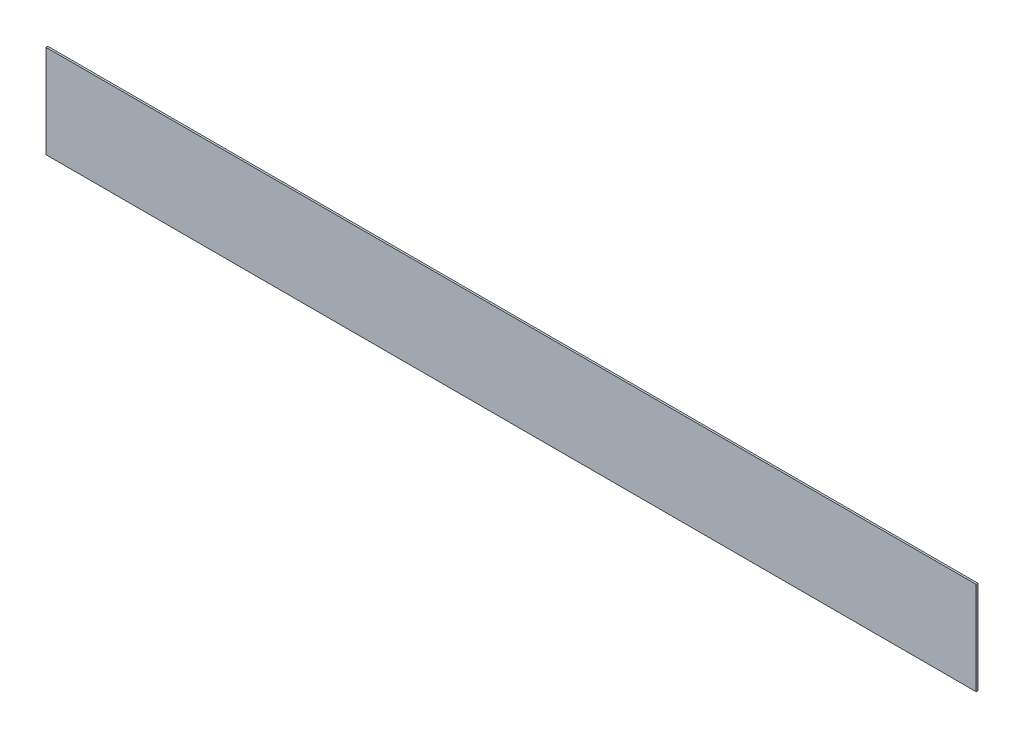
from build123d import *

# Parameters (mm, degrees)
ESQUISSE1_W        = 5000
ESQUISSE1_H        = 500
BOSS_EXTRU_1_DEPTH = 10


with BuildPart() as part:
    # Esquisse1 → Boss.-Extru.1 (new body)
    with BuildSketch(Plane.XY):
        with Locations((2500, 250)):
            Rectangle(ESQUISSE1_W, ESQUISSE1_H)
    extrude(amount=BOSS_EXTRU_1_DEPTH)


solid = part.part
